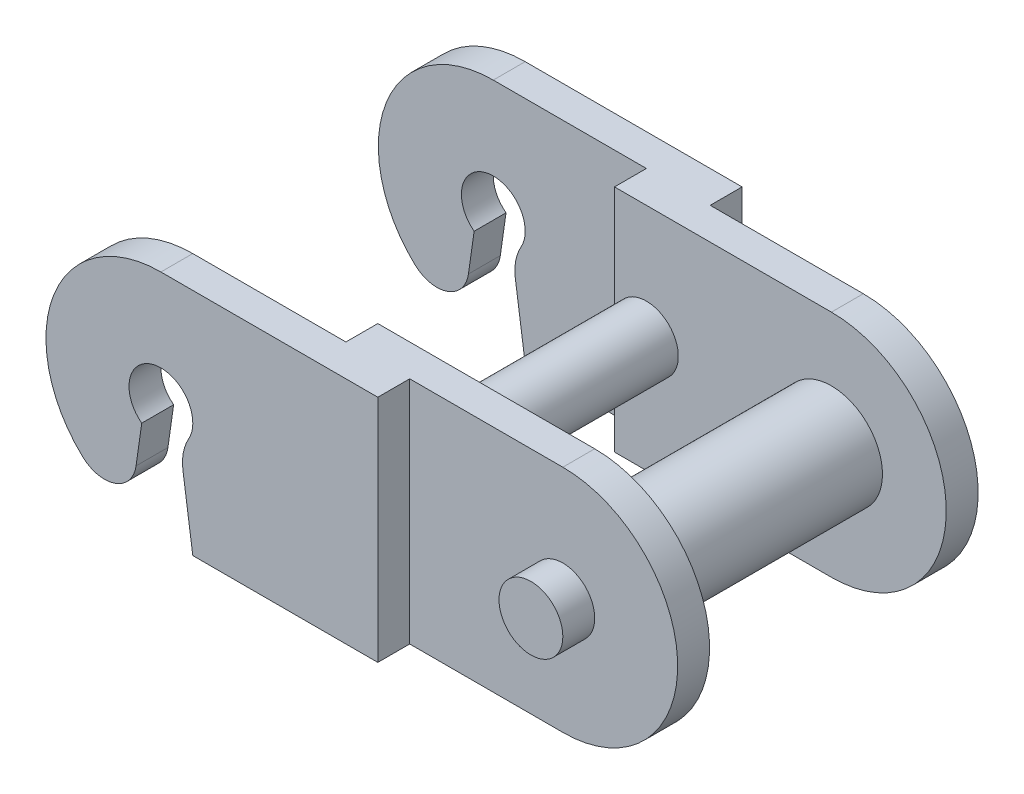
ISO-10303-21;
HEADER;
FILE_DESCRIPTION(('STEP AP214'),'2;1');
FILE_NAME('part.step','',(''),(''),'','','');
FILE_SCHEMA(('AUTOMOTIVE_DESIGN { 1 0 10303 214 1 1 1 1 }'));
ENDSEC;
DATA;
#1=APPLICATION_CONTEXT('core data for automotive mechanical design processes');
#2=APPLICATION_PROTOCOL_DEFINITION('international standard','automotive_design',2000,#1);
#3=PRODUCT_CONTEXT('',#1,'mechanical');
#4=PRODUCT('Part','Part','',(#3));
#5=PRODUCT_RELATED_PRODUCT_CATEGORY('part','',(#4));
#6=PRODUCT_DEFINITION_FORMATION('','',#4);
#7=PRODUCT_DEFINITION_CONTEXT('part definition',#1,'design');
#8=PRODUCT_DEFINITION('design','',#6,#7);
#9=PRODUCT_DEFINITION_SHAPE('','',#8);
#10=(LENGTH_UNIT() NAMED_UNIT(*) SI_UNIT(.MILLI.,.METRE.));
#11=(NAMED_UNIT(*) PLANE_ANGLE_UNIT() SI_UNIT($,.RADIAN.));
#12=(NAMED_UNIT(*) SI_UNIT($,.STERADIAN.) SOLID_ANGLE_UNIT());
#13=UNCERTAINTY_MEASURE_WITH_UNIT(LENGTH_MEASURE(1.E-05),#10,'distance_accuracy_value','');
#14=(GEOMETRIC_REPRESENTATION_CONTEXT(3) GLOBAL_UNCERTAINTY_ASSIGNED_CONTEXT((#13)) GLOBAL_UNIT_ASSIGNED_CONTEXT((#10,
#11,#12)) REPRESENTATION_CONTEXT('',''));
#15=CARTESIAN_POINT('',(0.,0.,0.));
#16=DIRECTION('',(0.,0.,1.));
#17=DIRECTION('',(1.,0.,0.));
#18=AXIS2_PLACEMENT_3D('',#15,#16,#17);
#19=CARTESIAN_POINT('',(-2.79567818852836,-1.8,-2.855));
#20=DIRECTION('',(0.,-1.,0.));
#21=DIRECTION('',(0.,0.,-1.));
#22=AXIS2_PLACEMENT_3D('',#19,#20,#21);
#23=PLANE('',#22);
#24=DIRECTION('',(-1.,0.,0.));
#25=VECTOR('',#24,1.);
#26=CARTESIAN_POINT('',(-0.5,-1.8,-2.355));
#27=LINE('',#26,#25);
#28=CARTESIAN_POINT('',(-0.5,-1.8,-2.355));
#29=VERTEX_POINT('',#28);
#30=CARTESIAN_POINT('',(-2.4,-1.8,-2.355));
#31=VERTEX_POINT('',#30);
#32=EDGE_CURVE('E246',#29,#31,#27,.T.);
#33=ORIENTED_EDGE('',*,*,#32,.T.);
#34=DIRECTION('',(0.,0.,1.));
#35=VECTOR('',#34,1.);
#36=CARTESIAN_POINT('',(-2.4,-1.8,-2.855));
#37=LINE('',#36,#35);
#38=CARTESIAN_POINT('',(-2.4,-1.8,-2.855));
#39=VERTEX_POINT('',#38);
#40=EDGE_CURVE('E222',#39,#31,#37,.T.);
#41=ORIENTED_EDGE('',*,*,#40,.F.);
#42=DIRECTION('',(1.,0.,0.));
#43=VECTOR('',#42,1.);
#44=CARTESIAN_POINT('',(-0.5,-1.8,-2.855));
#45=LINE('',#44,#43);
#46=CARTESIAN_POINT('',(0.5,-1.8,-2.855));
#47=VERTEX_POINT('',#46);
#48=EDGE_CURVE('E282',#39,#47,#45,.T.);
#49=ORIENTED_EDGE('',*,*,#48,.T.);
#50=DIRECTION('',(0.,0.,1.));
#51=VECTOR('',#50,1.);
#52=CARTESIAN_POINT('',(0.5,-1.8,-3.355));
#53=LINE('',#52,#51);
#54=CARTESIAN_POINT('',(0.5,-1.8,-2.355));
#55=VERTEX_POINT('',#54);
#56=EDGE_CURVE('E266',#47,#55,#53,.T.);
#57=ORIENTED_EDGE('',*,*,#56,.T.);
#58=DIRECTION('',(-1.,0.,0.));
#59=VECTOR('',#58,1.);
#60=CARTESIAN_POINT('',(0.5,-1.8,-2.355));
#61=LINE('',#60,#59);
#62=CARTESIAN_POINT('',(2.9,-1.8,-2.355));
#63=VERTEX_POINT('',#62);
#64=EDGE_CURVE('E262',#63,#55,#61,.T.);
#65=ORIENTED_EDGE('',*,*,#64,.F.);
#66=DIRECTION('',(0.,0.,1.));
#67=VECTOR('',#66,1.);
#68=CARTESIAN_POINT('',(2.9,-1.8,-2.855));
#69=LINE('',#68,#67);
#70=CARTESIAN_POINT('',(2.9,-1.8,-1.855));
#71=VERTEX_POINT('',#70);
#72=EDGE_CURVE('E284',#63,#71,#69,.T.);
#73=ORIENTED_EDGE('',*,*,#72,.T.);
#74=DIRECTION('',(1.,0.,0.));
#75=VECTOR('',#74,1.);
#76=CARTESIAN_POINT('',(-2.79567818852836,-1.8,-1.855));
#77=LINE('',#76,#75);
#78=CARTESIAN_POINT('',(-0.5,-1.8,-1.855));
#79=VERTEX_POINT('',#78);
#80=EDGE_CURVE('E279',#79,#71,#77,.T.);
#81=ORIENTED_EDGE('',*,*,#80,.F.);
#82=DIRECTION('',(0.,0.,1.));
#83=VECTOR('',#82,1.);
#84=CARTESIAN_POINT('',(-0.5,-1.8,-2.355));
#85=LINE('',#84,#83);
#86=EDGE_CURVE('E252',#29,#79,#85,.T.);
#87=ORIENTED_EDGE('',*,*,#86,.F.);
#88=EDGE_LOOP('',(#33,#41,#49,#57,#65,#73,#81,#87));
#89=FACE_BOUND('',#88,.T.);
#90=ADVANCED_FACE('F33',(#89),#23,.T.);
#91=CARTESIAN_POINT('',(-2.9,1.8,-2.855));
#92=DIRECTION('',(0.,-1.,0.));
#93=DIRECTION('',(0.,0.,-1.));
#94=AXIS2_PLACEMENT_3D('',#91,#92,#93);
#95=PLANE('',#94);
#96=DIRECTION('',(0.,0.,1.));
#97=VECTOR('',#96,1.);
#98=CARTESIAN_POINT('',(-0.5,1.8,-2.355));
#99=LINE('',#98,#97);
#100=CARTESIAN_POINT('',(-0.5,1.8,-2.355));
#101=VERTEX_POINT('',#100);
#102=CARTESIAN_POINT('',(-0.5,1.8,-1.855));
#103=VERTEX_POINT('',#102);
#104=EDGE_CURVE('E249',#101,#103,#99,.T.);
#105=ORIENTED_EDGE('',*,*,#104,.T.);
#106=DIRECTION('',(1.,0.,0.));
#107=VECTOR('',#106,1.);
#108=CARTESIAN_POINT('',(-2.9,1.8,-1.855));
#109=LINE('',#108,#107);
#110=CARTESIAN_POINT('',(2.9,1.8,-1.855));
#111=VERTEX_POINT('',#110);
#112=EDGE_CURVE('E274',#103,#111,#109,.T.);
#113=ORIENTED_EDGE('',*,*,#112,.T.);
#114=DIRECTION('',(0.,0.,1.));
#115=VECTOR('',#114,1.);
#116=CARTESIAN_POINT('',(2.9,1.8,-2.855));
#117=LINE('',#116,#115);
#118=CARTESIAN_POINT('',(2.9,1.8,-2.355));
#119=VERTEX_POINT('',#118);
#120=EDGE_CURVE('E292',#119,#111,#117,.T.);
#121=ORIENTED_EDGE('',*,*,#120,.F.);
#122=DIRECTION('',(1.,0.,0.));
#123=VECTOR('',#122,1.);
#124=CARTESIAN_POINT('',(0.5,1.8,-2.355));
#125=LINE('',#124,#123);
#126=CARTESIAN_POINT('',(0.5,1.8,-2.355));
#127=VERTEX_POINT('',#126);
#128=EDGE_CURVE('E264',#127,#119,#125,.T.);
#129=ORIENTED_EDGE('',*,*,#128,.F.);
#130=DIRECTION('',(0.,0.,1.));
#131=VECTOR('',#130,1.);
#132=CARTESIAN_POINT('',(0.5,1.8,-3.355));
#133=LINE('',#132,#131);
#134=CARTESIAN_POINT('',(0.5,1.8,-2.855));
#135=VERTEX_POINT('',#134);
#136=EDGE_CURVE('E267',#135,#127,#133,.T.);
#137=ORIENTED_EDGE('',*,*,#136,.F.);
#138=DIRECTION('',(1.,0.,0.));
#139=VECTOR('',#138,1.);
#140=CARTESIAN_POINT('',(-2.9,1.8,-2.855));
#141=LINE('',#140,#139);
#142=CARTESIAN_POINT('',(-2.9,1.8,-2.855));
#143=VERTEX_POINT('',#142);
#144=EDGE_CURVE('E278',#143,#135,#141,.T.);
#145=ORIENTED_EDGE('',*,*,#144,.F.);
#146=DIRECTION('',(0.,0.,1.));
#147=VECTOR('',#146,1.);
#148=CARTESIAN_POINT('',(-2.9,1.8,-2.855));
#149=LINE('',#148,#147);
#150=CARTESIAN_POINT('',(-2.9,1.8,-2.355));
#151=VERTEX_POINT('',#150);
#152=EDGE_CURVE('E295',#143,#151,#149,.T.);
#153=ORIENTED_EDGE('',*,*,#152,.T.);
#154=DIRECTION('',(1.,0.,0.));
#155=VECTOR('',#154,1.);
#156=CARTESIAN_POINT('',(-0.5,1.8,-2.355));
#157=LINE('',#156,#155);
#158=EDGE_CURVE('E243',#151,#101,#157,.T.);
#159=ORIENTED_EDGE('',*,*,#158,.T.);
#160=EDGE_LOOP('',(#105,#113,#121,#129,#137,#145,#153,#159));
#161=FACE_BOUND('',#160,.T.);
#162=ADVANCED_FACE('F456',(#161),#95,.F.);
#163=CARTESIAN_POINT('',(-2.9,-0.0015115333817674,-2.855));
#164=DIRECTION('',(0.,0.,1.));
#165=DIRECTION('',(1.,0.,0.));
#166=AXIS2_PLACEMENT_3D('',#163,#164,#165);
#167=CYLINDRICAL_SURFACE('',#166,1.80151153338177);
#168=CARTESIAN_POINT('',(-2.9,-0.0015115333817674,-2.855));
#169=DIRECTION('',(0.,0.,1.));
#170=DIRECTION('',(1.,0.,0.));
#171=AXIS2_PLACEMENT_3D('',#168,#169,#170);
#172=CIRCLE('',#171,1.80151153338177);
#173=CARTESIAN_POINT('',(-4.1242069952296,-1.32316240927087,-2.855));
#174=VERTEX_POINT('',#173);
#175=EDGE_CURVE('E275',#143,#174,#172,.T.);
#176=ORIENTED_EDGE('',*,*,#175,.T.);
#177=DIRECTION('',(0.,0.,1.));
#178=VECTOR('',#177,1.);
#179=CARTESIAN_POINT('',(-4.1242069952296,-1.32316240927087,-2.855));
#180=LINE('',#179,#178);
#181=CARTESIAN_POINT('',(-4.1242069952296,-1.32316240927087,-2.355));
#182=VERTEX_POINT('',#181);
#183=EDGE_CURVE('E436',#174,#182,#180,.T.);
#184=ORIENTED_EDGE('',*,*,#183,.T.);
#185=CARTESIAN_POINT('',(-2.9,-0.0015115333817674,-2.355));
#186=DIRECTION('',(0.,0.,1.));
#187=DIRECTION('',(1.,0.,0.));
#188=AXIS2_PLACEMENT_3D('',#185,#186,#187);
#189=CIRCLE('',#188,1.80151153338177);
#190=EDGE_CURVE('E426',#182,#151,#189,.F.);
#191=ORIENTED_EDGE('',*,*,#190,.T.);
#192=ORIENTED_EDGE('',*,*,#152,.F.);
#193=EDGE_LOOP('',(#176,#184,#191,#192));
#194=FACE_BOUND('',#193,.T.);
#195=ADVANCED_FACE('F451',(#194),#167,.T.);
#196=CARTESIAN_POINT('',(-2.9,-0.0015115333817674,-1.855));
#197=DIRECTION('',(0.,0.,-1.));
#198=DIRECTION('',(1.,0.,0.));
#199=AXIS2_PLACEMENT_3D('',#196,#197,#198);
#200=PLANE('',#199);
#201=CARTESIAN_POINT('',(2.9,0.,-1.855));
#202=DIRECTION('',(0.,0.,-1.));
#203=DIRECTION('',(-1.,0.,0.));
#204=AXIS2_PLACEMENT_3D('',#201,#202,#203);
#205=CIRCLE('',#204,0.8);
#206=CARTESIAN_POINT('',(2.1,0.,-1.855));
#207=VERTEX_POINT('',#206);
#208=EDGE_CURVE('E298',#207,#207,#205,.T.);
#209=ORIENTED_EDGE('',*,*,#208,.T.);
#210=EDGE_LOOP('',(#209));
#211=FACE_BOUND('',#210,.T.);
#212=DIRECTION('',(0.,1.,0.));
#213=VECTOR('',#212,1.);
#214=CARTESIAN_POINT('',(-0.5,-0.00151153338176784,-1.855));
#215=LINE('',#214,#213);
#216=CARTESIAN_POINT('',(-0.5,0.,-1.855));
#217=VERTEX_POINT('',#216);
#218=EDGE_CURVE('E424',#79,#217,#215,.T.);
#219=ORIENTED_EDGE('',*,*,#218,.F.);
#220=ORIENTED_EDGE('',*,*,#80,.T.);
#221=CARTESIAN_POINT('',(2.9,0.,-1.855));
#222=DIRECTION('',(0.,0.,-1.));
#223=DIRECTION('',(-1.,0.,0.));
#224=AXIS2_PLACEMENT_3D('',#221,#222,#223);
#225=CIRCLE('',#224,1.8);
#226=EDGE_CURVE('E286',#111,#71,#225,.T.);
#227=ORIENTED_EDGE('',*,*,#226,.F.);
#228=ORIENTED_EDGE('',*,*,#112,.F.);
#229=DIRECTION('',(0.,-1.,0.));
#230=VECTOR('',#229,1.);
#231=CARTESIAN_POINT('',(-0.5,1.8,-1.855));
#232=LINE('',#231,#230);
#233=EDGE_CURVE('E221',#103,#217,#232,.T.);
#234=ORIENTED_EDGE('',*,*,#233,.T.);
#235=CARTESIAN_POINT('',(0.,0.,-1.855));
#236=DIRECTION('',(0.,0.,-1.));
#237=DIRECTION('',(-1.,0.,0.));
#238=AXIS2_PLACEMENT_3D('',#235,#236,#237);
#239=CIRCLE('',#238,0.5);
#240=EDGE_CURVE('E301',#217,#217,#239,.T.);
#241=ORIENTED_EDGE('',*,*,#240,.T.);
#242=EDGE_LOOP('',(#219,#220,#227,#228,#234,#241));
#243=FACE_BOUND('',#242,.T.);
#244=ADVANCED_FACE('F481',(#211,#243),#200,.F.);
#245=CARTESIAN_POINT('',(2.9,0.,-2.855));
#246=DIRECTION('',(0.,0.,1.));
#247=DIRECTION('',(1.,0.,0.));
#248=AXIS2_PLACEMENT_3D('',#245,#246,#247);
#249=CYLINDRICAL_SURFACE('',#248,1.8);
#250=CARTESIAN_POINT('',(2.9,0.,-2.355));
#251=DIRECTION('',(0.,0.,-1.));
#252=DIRECTION('',(-1.,0.,0.));
#253=AXIS2_PLACEMENT_3D('',#250,#251,#252);
#254=CIRCLE('',#253,1.8);
#255=EDGE_CURVE('E272',#119,#63,#254,.T.);
#256=ORIENTED_EDGE('',*,*,#255,.F.);
#257=ORIENTED_EDGE('',*,*,#120,.T.);
#258=ORIENTED_EDGE('',*,*,#226,.T.);
#259=ORIENTED_EDGE('',*,*,#72,.F.);
#260=EDGE_LOOP('',(#256,#257,#258,#259));
#261=FACE_BOUND('',#260,.T.);
#262=ADVANCED_FACE('F483',(#261),#249,.T.);
#263=CARTESIAN_POINT('',(-2.9,-0.0015115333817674,2.855));
#264=DIRECTION('',(0.,0.,-1.));
#265=DIRECTION('',(-1.,0.,0.));
#266=AXIS2_PLACEMENT_3D('',#263,#264,#265);
#267=CYLINDRICAL_SURFACE('',#266,1.80151153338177);
#268=CARTESIAN_POINT('',(-2.9,-0.0015115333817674,2.355));
#269=DIRECTION('',(0.,0.,-1.));
#270=DIRECTION('',(-1.,0.,0.));
#271=AXIS2_PLACEMENT_3D('',#268,#269,#270);
#272=CIRCLE('',#271,1.80151153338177);
#273=CARTESIAN_POINT('',(-4.1242069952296,-1.32316240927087,2.355));
#274=VERTEX_POINT('',#273);
#275=CARTESIAN_POINT('',(-2.9,1.8,2.355));
#276=VERTEX_POINT('',#275);
#277=EDGE_CURVE('E330',#274,#276,#272,.T.);
#278=ORIENTED_EDGE('',*,*,#277,.F.);
#279=DIRECTION('',(0.,0.,-1.));
#280=VECTOR('',#279,1.);
#281=CARTESIAN_POINT('',(-4.1242069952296,-1.32316240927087,2.855));
#282=LINE('',#281,#280);
#283=CARTESIAN_POINT('',(-4.1242069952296,-1.32316240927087,2.855));
#284=VERTEX_POINT('',#283);
#285=EDGE_CURVE('E406',#274,#284,#282,.F.);
#286=ORIENTED_EDGE('',*,*,#285,.T.);
#287=CARTESIAN_POINT('',(-2.9,-0.0015115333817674,2.855));
#288=DIRECTION('',(0.,0.,1.));
#289=DIRECTION('',(1.,0.,0.));
#290=AXIS2_PLACEMENT_3D('',#287,#288,#289);
#291=CIRCLE('',#290,1.80151153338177);
#292=CARTESIAN_POINT('',(-2.9,1.8,2.855));
#293=VERTEX_POINT('',#292);
#294=EDGE_CURVE('E356',#293,#284,#291,.T.);
#295=ORIENTED_EDGE('',*,*,#294,.F.);
#296=DIRECTION('',(0.,0.,-1.));
#297=VECTOR('',#296,1.);
#298=CARTESIAN_POINT('',(-2.9,1.8,2.855));
#299=LINE('',#298,#297);
#300=EDGE_CURVE('E365',#293,#276,#299,.T.);
#301=ORIENTED_EDGE('',*,*,#300,.T.);
#302=EDGE_LOOP('',(#278,#286,#295,#301));
#303=FACE_BOUND('',#302,.T.);
#304=ADVANCED_FACE('F485',(#303),#267,.T.);
#305=CARTESIAN_POINT('',(-2.9,-0.0015115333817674,2.855));
#306=DIRECTION('',(0.,0.,1.));
#307=DIRECTION('',(1.,0.,0.));
#308=AXIS2_PLACEMENT_3D('',#305,#306,#307);
#309=PLANE('',#308);
#310=CARTESIAN_POINT('',(-2.9,-0.0015115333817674,2.855));
#311=DIRECTION('',(0.,0.,-1.));
#312=DIRECTION('',(-1.,0.,0.));
#313=AXIS2_PLACEMENT_3D('',#310,#311,#312);
#314=CIRCLE('',#313,0.5);
#315=CARTESIAN_POINT('',(-3.2,-0.401511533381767,2.855));
#316=VERTEX_POINT('',#315);
#317=CARTESIAN_POINT('',(-2.46465953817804,-0.247435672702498,2.855));
#318=VERTEX_POINT('',#317);
#319=EDGE_CURVE('E309',#316,#318,#314,.T.);
#320=ORIENTED_EDGE('',*,*,#319,.T.);
#321=CARTESIAN_POINT('',(-1.8116488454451,-0.616321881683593,2.855));
#322=DIRECTION('',(0.,0.,1.));
#323=DIRECTION('',(1.,0.,0.));
#324=AXIS2_PLACEMENT_3D('',#321,#322,#323);
#325=CIRCLE('',#324,0.75);
#326=CARTESIAN_POINT('',(-2.55409490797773,-0.722500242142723,2.855));
#327=VERTEX_POINT('',#326);
#328=EDGE_CURVE('E417',#318,#327,#325,.T.);
#329=ORIENTED_EDGE('',*,*,#328,.T.);
#330=DIRECTION('',(0.14157114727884,-0.989928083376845,0.));
#331=VECTOR('',#330,1.);
#332=CARTESIAN_POINT('',(-2.6,-0.401511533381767,2.855));
#333=LINE('',#332,#331);
#334=CARTESIAN_POINT('',(-2.4,-1.8,2.855));
#335=VERTEX_POINT('',#334);
#336=EDGE_CURVE('E307',#327,#335,#333,.T.);
#337=ORIENTED_EDGE('',*,*,#336,.T.);
#338=DIRECTION('',(1.,0.,0.));
#339=VECTOR('',#338,1.);
#340=CARTESIAN_POINT('',(-2.79567818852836,-1.8,2.855));
#341=LINE('',#340,#339);
#342=CARTESIAN_POINT('',(0.5,-1.8,2.855));
#343=VERTEX_POINT('',#342);
#344=EDGE_CURVE('E359',#335,#343,#341,.T.);
#345=ORIENTED_EDGE('',*,*,#344,.T.);
#346=DIRECTION('',(0.,-1.,0.));
#347=VECTOR('',#346,1.);
#348=CARTESIAN_POINT('',(0.5,-0.00151153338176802,2.855));
#349=LINE('',#348,#347);
#350=CARTESIAN_POINT('',(0.5,1.8,2.855));
#351=VERTEX_POINT('',#350);
#352=EDGE_CURVE('E385',#351,#343,#349,.T.);
#353=ORIENTED_EDGE('',*,*,#352,.F.);
#354=DIRECTION('',(1.,0.,0.));
#355=VECTOR('',#354,1.);
#356=CARTESIAN_POINT('',(-2.9,1.8,2.855));
#357=LINE('',#356,#355);
#358=EDGE_CURVE('E362',#293,#351,#357,.T.);
#359=ORIENTED_EDGE('',*,*,#358,.F.);
#360=ORIENTED_EDGE('',*,*,#294,.T.);
#361=CARTESIAN_POINT('',(-3.78443481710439,-0.956345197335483,2.855));
#362=DIRECTION('',(0.,0.,1.));
#363=DIRECTION('',(1.,0.,0.));
#364=AXIS2_PLACEMENT_3D('',#361,#362,#363);
#365=CIRCLE('',#364,0.5);
#366=CARTESIAN_POINT('',(-3.28947077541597,-1.0271307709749,2.855));
#367=VERTEX_POINT('',#366);
#368=EDGE_CURVE('E408',#284,#367,#365,.T.);
#369=ORIENTED_EDGE('',*,*,#368,.T.);
#370=DIRECTION('',(-0.14157114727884,-0.989928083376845,0.));
#371=VECTOR('',#370,1.);
#372=CARTESIAN_POINT('',(-3.2,-0.401511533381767,2.855));
#373=LINE('',#372,#371);
#374=EDGE_CURVE('E304',#316,#367,#373,.T.);
#375=ORIENTED_EDGE('',*,*,#374,.F.);
#376=EDGE_LOOP('',(#320,#329,#337,#345,#353,#359,#360,#369,#375));
#377=FACE_BOUND('',#376,.T.);
#378=ADVANCED_FACE('F508',(#377),#309,.T.);
#379=CARTESIAN_POINT('',(0.,0.,2.355));
#380=DIRECTION('',(0.,0.,-1.));
#381=DIRECTION('',(-1.,0.,0.));
#382=AXIS2_PLACEMENT_3D('',#379,#380,#381);
#383=PLANE('',#382);
#384=DIRECTION('',(0.14157114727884,-0.989928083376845,0.));
#385=VECTOR('',#384,1.);
#386=CARTESIAN_POINT('',(-2.60415972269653,-0.372424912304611,2.355));
#387=LINE('',#386,#385);
#388=CARTESIAN_POINT('',(-2.55409490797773,-0.722500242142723,2.355));
#389=VERTEX_POINT('',#388);
#390=CARTESIAN_POINT('',(-2.4,-1.8,2.355));
#391=VERTEX_POINT('',#390);
#392=EDGE_CURVE('E396',#389,#391,#387,.T.);
#393=ORIENTED_EDGE('',*,*,#392,.F.);
#394=CARTESIAN_POINT('',(-1.8116488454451,-0.616321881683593,2.355));
#395=DIRECTION('',(0.,0.,-1.));
#396=DIRECTION('',(-1.,0.,0.));
#397=AXIS2_PLACEMENT_3D('',#394,#395,#396);
#398=CIRCLE('',#397,0.75);
#399=CARTESIAN_POINT('',(-2.46465953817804,-0.247435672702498,2.355));
#400=VERTEX_POINT('',#399);
#401=EDGE_CURVE('E413',#389,#400,#398,.T.);
#402=ORIENTED_EDGE('',*,*,#401,.T.);
#403=CARTESIAN_POINT('',(-2.9,-0.0015115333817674,2.355));
#404=DIRECTION('',(0.,0.,-1.));
#405=DIRECTION('',(-1.,0.,0.));
#406=AXIS2_PLACEMENT_3D('',#403,#404,#405);
#407=CIRCLE('',#406,0.5);
#408=CARTESIAN_POINT('',(-3.2,-0.401511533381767,2.355));
#409=VERTEX_POINT('',#408);
#410=EDGE_CURVE('E393',#409,#400,#407,.T.);
#411=ORIENTED_EDGE('',*,*,#410,.F.);
#412=DIRECTION('',(-0.14157114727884,-0.989928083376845,0.));
#413=VECTOR('',#412,1.);
#414=CARTESIAN_POINT('',(-3.07959441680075,0.440417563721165,2.355));
#415=LINE('',#414,#413);
#416=CARTESIAN_POINT('',(-3.28947077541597,-1.0271307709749,2.355));
#417=VERTEX_POINT('',#416);
#418=EDGE_CURVE('E398',#409,#417,#415,.T.);
#419=ORIENTED_EDGE('',*,*,#418,.T.);
#420=CARTESIAN_POINT('',(-3.78443481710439,-0.956345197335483,2.355));
#421=DIRECTION('',(0.,0.,-1.));
#422=DIRECTION('',(-1.,0.,0.));
#423=AXIS2_PLACEMENT_3D('',#420,#421,#422);
#424=CIRCLE('',#423,0.5);
#425=EDGE_CURVE('E404',#417,#274,#424,.T.);
#426=ORIENTED_EDGE('',*,*,#425,.T.);
#427=ORIENTED_EDGE('',*,*,#277,.T.);
#428=DIRECTION('',(1.,0.,0.));
#429=VECTOR('',#428,1.);
#430=CARTESIAN_POINT('',(-0.5,1.8,2.355));
#431=LINE('',#430,#429);
#432=CARTESIAN_POINT('',(-0.5,1.8,2.355));
#433=VERTEX_POINT('',#432);
#434=EDGE_CURVE('E324',#276,#433,#431,.T.);
#435=ORIENTED_EDGE('',*,*,#434,.T.);
#436=DIRECTION('',(0.,-1.,0.));
#437=VECTOR('',#436,1.);
#438=CARTESIAN_POINT('',(-0.5,1.8,2.355));
#439=LINE('',#438,#437);
#440=CARTESIAN_POINT('',(-0.5,-1.8,2.355));
#441=VERTEX_POINT('',#440);
#442=EDGE_CURVE('E318',#433,#441,#439,.T.);
#443=ORIENTED_EDGE('',*,*,#442,.T.);
#444=DIRECTION('',(-1.,0.,0.));
#445=VECTOR('',#444,1.);
#446=CARTESIAN_POINT('',(-0.5,-1.8,2.355));
#447=LINE('',#446,#445);
#448=EDGE_CURVE('E321',#441,#391,#447,.T.);
#449=ORIENTED_EDGE('',*,*,#448,.T.);
#450=EDGE_LOOP('',(#393,#402,#411,#419,#426,#427,#435,#443,#449));
#451=FACE_BOUND('',#450,.T.);
#452=ADVANCED_FACE('F504',(#451),#383,.T.);
#453=CARTESIAN_POINT('',(-2.9,-0.0015115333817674,1.855));
#454=DIRECTION('',(0.,0.,1.));
#455=DIRECTION('',(1.,0.,0.));
#456=AXIS2_PLACEMENT_3D('',#453,#454,#455);
#457=PLANE('',#456);
#458=DIRECTION('',(1.,0.,0.));
#459=VECTOR('',#458,1.);
#460=CARTESIAN_POINT('',(-0.5,-1.8,1.855));
#461=LINE('',#460,#459);
#462=CARTESIAN_POINT('',(-0.5,-1.8,1.855));
#463=VERTEX_POINT('',#462);
#464=CARTESIAN_POINT('',(2.9,-1.8,1.855));
#465=VERTEX_POINT('',#464);
#466=EDGE_CURVE('E355',#463,#465,#461,.T.);
#467=ORIENTED_EDGE('',*,*,#466,.F.);
#468=DIRECTION('',(0.,1.,0.));
#469=VECTOR('',#468,1.);
#470=CARTESIAN_POINT('',(-0.5,-0.00151153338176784,1.855));
#471=LINE('',#470,#469);
#472=CARTESIAN_POINT('',(-0.5,0.,1.855));
#473=VERTEX_POINT('',#472);
#474=EDGE_CURVE('E390',#463,#473,#471,.T.);
#475=ORIENTED_EDGE('',*,*,#474,.T.);
#476=CARTESIAN_POINT('',(0.,0.,1.855));
#477=DIRECTION('',(0.,0.,1.));
#478=DIRECTION('',(1.,0.,0.));
#479=AXIS2_PLACEMENT_3D('',#476,#477,#478);
#480=CIRCLE('',#479,0.5);
#481=EDGE_CURVE('E379',#473,#473,#480,.T.);
#482=ORIENTED_EDGE('',*,*,#481,.T.);
#483=DIRECTION('',(0.,-1.,0.));
#484=VECTOR('',#483,1.);
#485=CARTESIAN_POINT('',(-0.5,1.8,1.855));
#486=LINE('',#485,#484);
#487=CARTESIAN_POINT('',(-0.5,1.8,1.855));
#488=VERTEX_POINT('',#487);
#489=EDGE_CURVE('E317',#488,#473,#486,.T.);
#490=ORIENTED_EDGE('',*,*,#489,.F.);
#491=DIRECTION('',(1.,0.,0.));
#492=VECTOR('',#491,1.);
#493=CARTESIAN_POINT('',(-2.9,1.8,1.855));
#494=LINE('',#493,#492);
#495=CARTESIAN_POINT('',(2.9,1.8,1.855));
#496=VERTEX_POINT('',#495);
#497=EDGE_CURVE('E360',#488,#496,#494,.T.);
#498=ORIENTED_EDGE('',*,*,#497,.T.);
#499=CARTESIAN_POINT('',(2.9,0.,1.855));
#500=DIRECTION('',(0.,0.,-1.));
#501=DIRECTION('',(-1.,0.,0.));
#502=AXIS2_PLACEMENT_3D('',#499,#500,#501);
#503=CIRCLE('',#502,1.8);
#504=EDGE_CURVE('E367',#496,#465,#503,.T.);
#505=ORIENTED_EDGE('',*,*,#504,.T.);
#506=EDGE_LOOP('',(#467,#475,#482,#490,#498,#505));
#507=FACE_BOUND('',#506,.T.);
#508=CARTESIAN_POINT('',(2.9,0.,1.855));
#509=DIRECTION('',(0.,0.,1.));
#510=DIRECTION('',(1.,0.,0.));
#511=AXIS2_PLACEMENT_3D('',#508,#509,#510);
#512=CIRCLE('',#511,0.8);
#513=CARTESIAN_POINT('',(2.1,0.,1.855));
#514=VERTEX_POINT('',#513);
#515=EDGE_CURVE('E382',#514,#514,#512,.F.);
#516=ORIENTED_EDGE('',*,*,#515,.F.);
#517=EDGE_LOOP('',(#516));
#518=FACE_BOUND('',#517,.T.);
#519=ADVANCED_FACE('F507',(#507,#518),#457,.F.);
#520=CARTESIAN_POINT('',(2.9,0.,2.855));
#521=DIRECTION('',(0.,0.,-1.));
#522=DIRECTION('',(-1.,0.,0.));
#523=AXIS2_PLACEMENT_3D('',#520,#521,#522);
#524=CYLINDRICAL_SURFACE('',#523,1.8);
#525=DIRECTION('',(0.,0.,-1.));
#526=VECTOR('',#525,1.);
#527=CARTESIAN_POINT('',(2.9,1.8,2.855));
#528=LINE('',#527,#526);
#529=CARTESIAN_POINT('',(2.9,1.8,2.355));
#530=VERTEX_POINT('',#529);
#531=EDGE_CURVE('E373',#530,#496,#528,.T.);
#532=ORIENTED_EDGE('',*,*,#531,.F.);
#533=CARTESIAN_POINT('',(2.9,0.,2.355));
#534=DIRECTION('',(0.,0.,1.));
#535=DIRECTION('',(1.,0.,0.));
#536=AXIS2_PLACEMENT_3D('',#533,#534,#535);
#537=CIRCLE('',#536,1.8);
#538=CARTESIAN_POINT('',(2.9,-1.8,2.355));
#539=VERTEX_POINT('',#538);
#540=EDGE_CURVE('E352',#530,#539,#537,.F.);
#541=ORIENTED_EDGE('',*,*,#540,.T.);
#542=DIRECTION('',(0.,0.,-1.));
#543=VECTOR('',#542,1.);
#544=CARTESIAN_POINT('',(2.9,-1.8,2.855));
#545=LINE('',#544,#543);
#546=EDGE_CURVE('E376',#539,#465,#545,.T.);
#547=ORIENTED_EDGE('',*,*,#546,.T.);
#548=ORIENTED_EDGE('',*,*,#504,.F.);
#549=EDGE_LOOP('',(#532,#541,#547,#548));
#550=FACE_BOUND('',#549,.T.);
#551=ADVANCED_FACE('F536',(#550),#524,.T.);
#552=CARTESIAN_POINT('',(0.,0.,1.855));
#553=DIRECTION('',(0.,0.,-1.));
#554=DIRECTION('',(-1.,0.,0.));
#555=AXIS2_PLACEMENT_3D('',#552,#553,#554);
#556=CYLINDRICAL_SURFACE('',#555,0.5);
#557=ORIENTED_EDGE('',*,*,#481,.F.);
#558=EDGE_LOOP('',(#557));
#559=FACE_BOUND('',#558,.T.);
#560=ORIENTED_EDGE('',*,*,#240,.F.);
#561=EDGE_LOOP('',(#560));
#562=FACE_BOUND('',#561,.T.);
#563=ADVANCED_FACE('F544',(#559,#562),#556,.T.);
#564=CARTESIAN_POINT('',(-0.5,-1.8,2.855));
#565=DIRECTION('',(0.,1.,0.));
#566=DIRECTION('',(0.,0.,1.));
#567=AXIS2_PLACEMENT_3D('',#564,#565,#566);
#568=PLANE('',#567);
#569=ORIENTED_EDGE('',*,*,#344,.F.);
#570=DIRECTION('',(0.,0.,-1.));
#571=VECTOR('',#570,1.);
#572=CARTESIAN_POINT('',(-2.4,-1.8,2.855));
#573=LINE('',#572,#571);
#574=EDGE_CURVE('E314',#335,#391,#573,.T.);
#575=ORIENTED_EDGE('',*,*,#574,.T.);
#576=ORIENTED_EDGE('',*,*,#448,.F.);
#577=DIRECTION('',(0.,0.,-1.));
#578=VECTOR('',#577,1.);
#579=CARTESIAN_POINT('',(-0.5,-1.8,2.355));
#580=LINE('',#579,#578);
#581=EDGE_CURVE('E326',#441,#463,#580,.T.);
#582=ORIENTED_EDGE('',*,*,#581,.T.);
#583=ORIENTED_EDGE('',*,*,#466,.T.);
#584=ORIENTED_EDGE('',*,*,#546,.F.);
#585=DIRECTION('',(-1.,0.,0.));
#586=VECTOR('',#585,1.);
#587=CARTESIAN_POINT('',(0.5,-1.8,2.355));
#588=LINE('',#587,#586);
#589=CARTESIAN_POINT('',(0.5,-1.8,2.355));
#590=VERTEX_POINT('',#589);
#591=EDGE_CURVE('E343',#539,#590,#588,.T.);
#592=ORIENTED_EDGE('',*,*,#591,.T.);
#593=DIRECTION('',(0.,0.,-1.));
#594=VECTOR('',#593,1.);
#595=CARTESIAN_POINT('',(0.5,-1.8,3.355));
#596=LINE('',#595,#594);
#597=EDGE_CURVE('E347',#343,#590,#596,.T.);
#598=ORIENTED_EDGE('',*,*,#597,.F.);
#599=EDGE_LOOP('',(#569,#575,#576,#582,#583,#584,#592,#598));
#600=FACE_BOUND('',#599,.T.);
#601=ADVANCED_FACE('F540',(#600),#568,.F.);
#602=CARTESIAN_POINT('',(-2.9,1.8,2.855));
#603=DIRECTION('',(0.,1.,0.));
#604=DIRECTION('',(0.,0.,1.));
#605=AXIS2_PLACEMENT_3D('',#602,#603,#604);
#606=PLANE('',#605);
#607=DIRECTION('',(0.,0.,-1.));
#608=VECTOR('',#607,1.);
#609=CARTESIAN_POINT('',(-0.5,1.8,2.355));
#610=LINE('',#609,#608);
#611=EDGE_CURVE('E328',#433,#488,#610,.T.);
#612=ORIENTED_EDGE('',*,*,#611,.F.);
#613=ORIENTED_EDGE('',*,*,#434,.F.);
#614=ORIENTED_EDGE('',*,*,#300,.F.);
#615=ORIENTED_EDGE('',*,*,#358,.T.);
#616=DIRECTION('',(0.,0.,-1.));
#617=VECTOR('',#616,1.);
#618=CARTESIAN_POINT('',(0.5,1.8,3.355));
#619=LINE('',#618,#617);
#620=CARTESIAN_POINT('',(0.5,1.8,2.355));
#621=VERTEX_POINT('',#620);
#622=EDGE_CURVE('E346',#351,#621,#619,.T.);
#623=ORIENTED_EDGE('',*,*,#622,.T.);
#624=DIRECTION('',(1.,0.,0.));
#625=VECTOR('',#624,1.);
#626=CARTESIAN_POINT('',(0.5,1.8,2.355));
#627=LINE('',#626,#625);
#628=EDGE_CURVE('E340',#621,#530,#627,.T.);
#629=ORIENTED_EDGE('',*,*,#628,.T.);
#630=ORIENTED_EDGE('',*,*,#531,.T.);
#631=ORIENTED_EDGE('',*,*,#497,.F.);
#632=EDGE_LOOP('',(#612,#613,#614,#615,#623,#629,#630,#631));
#633=FACE_BOUND('',#632,.T.);
#634=ADVANCED_FACE('F529',(#633),#606,.T.);
#635=CARTESIAN_POINT('',(2.9,0.,1.855));
#636=DIRECTION('',(0.,0.,-1.));
#637=DIRECTION('',(-1.,0.,0.));
#638=AXIS2_PLACEMENT_3D('',#635,#636,#637);
#639=CYLINDRICAL_SURFACE('',#638,0.8);
#640=CARTESIAN_POINT('',(2.1,0.,1.855));
#641=CARTESIAN_POINT('',(2.1,0.,1.81635416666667));
#642=CARTESIAN_POINT('',(2.1,0.,1.77770833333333));
#643=CARTESIAN_POINT('',(2.1,0.,1.70041666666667));
#644=CARTESIAN_POINT('',(2.1,0.,1.66177083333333));
#645=CARTESIAN_POINT('',(2.1,0.,1.58447916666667));
#646=CARTESIAN_POINT('',(2.1,0.,1.54583333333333));
#647=CARTESIAN_POINT('',(2.1,0.,1.46854166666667));
#648=CARTESIAN_POINT('',(2.1,0.,1.42989583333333));
#649=CARTESIAN_POINT('',(2.1,0.,1.35260416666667));
#650=CARTESIAN_POINT('',(2.1,0.,1.31395833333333));
#651=CARTESIAN_POINT('',(2.1,0.,1.23666666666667));
#652=CARTESIAN_POINT('',(2.1,0.,1.19802083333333));
#653=CARTESIAN_POINT('',(2.1,0.,1.12072916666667));
#654=CARTESIAN_POINT('',(2.1,0.,1.08208333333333));
#655=CARTESIAN_POINT('',(2.1,0.,1.00479166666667));
#656=CARTESIAN_POINT('',(2.1,0.,0.966145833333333));
#657=CARTESIAN_POINT('',(2.1,0.,0.888854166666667));
#658=CARTESIAN_POINT('',(2.1,0.,0.850208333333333));
#659=CARTESIAN_POINT('',(2.1,0.,0.772916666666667));
#660=CARTESIAN_POINT('',(2.1,0.,0.734270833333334));
#661=CARTESIAN_POINT('',(2.1,0.,0.656979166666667));
#662=CARTESIAN_POINT('',(2.1,0.,0.618333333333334));
#663=CARTESIAN_POINT('',(2.1,0.,0.541041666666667));
#664=CARTESIAN_POINT('',(2.1,0.,0.502395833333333));
#665=CARTESIAN_POINT('',(2.1,0.,0.425104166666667));
#666=CARTESIAN_POINT('',(2.1,0.,0.386458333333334));
#667=CARTESIAN_POINT('',(2.1,0.,0.309166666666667));
#668=CARTESIAN_POINT('',(2.1,0.,0.270520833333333));
#669=CARTESIAN_POINT('',(2.1,0.,0.193229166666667));
#670=CARTESIAN_POINT('',(2.1,0.,0.154583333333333));
#671=CARTESIAN_POINT('',(2.1,0.,0.0772916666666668));
#672=CARTESIAN_POINT('',(2.1,0.,0.0386458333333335));
#673=CARTESIAN_POINT('',(2.1,0.,-0.0386458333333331));
#674=CARTESIAN_POINT('',(2.1,0.,-0.0772916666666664));
#675=CARTESIAN_POINT('',(2.1,0.,-0.154583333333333));
#676=CARTESIAN_POINT('',(2.1,0.,-0.193229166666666));
#677=CARTESIAN_POINT('',(2.1,0.,-0.270520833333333));
#678=CARTESIAN_POINT('',(2.1,0.,-0.309166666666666));
#679=CARTESIAN_POINT('',(2.1,0.,-0.386458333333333));
#680=CARTESIAN_POINT('',(2.1,0.,-0.425104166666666));
#681=CARTESIAN_POINT('',(2.1,0.,-0.502395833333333));
#682=CARTESIAN_POINT('',(2.1,0.,-0.541041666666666));
#683=CARTESIAN_POINT('',(2.1,0.,-0.618333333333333));
#684=CARTESIAN_POINT('',(2.1,0.,-0.656979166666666));
#685=CARTESIAN_POINT('',(2.1,0.,-0.734270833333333));
#686=CARTESIAN_POINT('',(2.1,0.,-0.772916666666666));
#687=CARTESIAN_POINT('',(2.1,0.,-0.850208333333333));
#688=CARTESIAN_POINT('',(2.1,0.,-0.888854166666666));
#689=CARTESIAN_POINT('',(2.1,0.,-0.966145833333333));
#690=CARTESIAN_POINT('',(2.1,0.,-1.00479166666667));
#691=CARTESIAN_POINT('',(2.1,0.,-1.08208333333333));
#692=CARTESIAN_POINT('',(2.1,0.,-1.12072916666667));
#693=CARTESIAN_POINT('',(2.1,0.,-1.19802083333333));
#694=CARTESIAN_POINT('',(2.1,0.,-1.23666666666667));
#695=CARTESIAN_POINT('',(2.1,0.,-1.31395833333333));
#696=CARTESIAN_POINT('',(2.1,0.,-1.35260416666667));
#697=CARTESIAN_POINT('',(2.1,0.,-1.42989583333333));
#698=CARTESIAN_POINT('',(2.1,0.,-1.46854166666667));
#699=CARTESIAN_POINT('',(2.1,0.,-1.54583333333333));
#700=CARTESIAN_POINT('',(2.1,0.,-1.58447916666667));
#701=CARTESIAN_POINT('',(2.1,0.,-1.66177083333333));
#702=CARTESIAN_POINT('',(2.1,0.,-1.70041666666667));
#703=CARTESIAN_POINT('',(2.1,0.,-1.77770833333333));
#704=CARTESIAN_POINT('',(2.1,0.,-1.81635416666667));
#705=CARTESIAN_POINT('',(2.1,0.,-1.855));
#706=B_SPLINE_CURVE_WITH_KNOTS('',3,(#640,#641,#642,#643,#644,#645,#646,#647,#648,#649,#650,
#651,#652,#653,#654,#655,#656,#657,#658,#659,#660,#661,#662,#663,#664,#665,#666,#667,#668,#669,
#670,#671,#672,#673,#674,#675,#676,#677,#678,#679,#680,#681,#682,#683,#684,#685,#686,#687,#688,
#689,#690,#691,#692,#693,#694,#695,#696,#697,#698,#699,#700,#701,#702,#703,#704,#705),
.UNSPECIFIED.,.F.,.F.,(4,2,2,2,2,2,2,2,2,2,2,2,2,2,2,2,2,2,2,2,2,2,2,2,2,2,2,2,2,2,2,2,4),(0.,
0.1159375,0.231875,0.3478125,0.46375,0.5796875,0.695625,0.8115625,0.9275,1.0434375,1.159375,
1.2753125,1.39125,1.5071875,1.623125,1.7390625,1.855,1.9709375,2.086875,2.2028125,2.31875,
2.4346875,2.550625,2.6665625,2.7825,2.8984375,3.014375,3.1303125,3.24625,3.3621875,3.478125,
3.5940625,3.71),.UNSPECIFIED.);
#707=EDGE_CURVE('BSEAM525',#514,#207,#706,.T.);
#708=ORIENTED_EDGE('',*,*,#515,.T.);
#709=ORIENTED_EDGE('',*,*,#208,.F.);
#710=ORIENTED_EDGE('',*,*,#707,.T.);
#711=ORIENTED_EDGE('',*,*,#707,.F.);
#712=EDGE_LOOP('',(#708,#710,#709,#711));
#713=FACE_BOUND('',#712,.T.);
#714=ADVANCED_FACE('F525',(#713),#639,.T.);
#715=CARTESIAN_POINT('',(0.5,1.8,3.355));
#716=DIRECTION('',(-1.,0.,0.));
#717=DIRECTION('',(0.,-1.,0.));
#718=AXIS2_PLACEMENT_3D('',#715,#716,#717);
#719=PLANE('',#718);
#720=ORIENTED_EDGE('',*,*,#352,.T.);
#721=ORIENTED_EDGE('',*,*,#597,.T.);
#722=DIRECTION('',(0.,1.,0.));
#723=VECTOR('',#722,1.);
#724=CARTESIAN_POINT('',(0.5,1.8,2.355));
#725=LINE('',#724,#723);
#726=EDGE_CURVE('E337',#590,#621,#725,.T.);
#727=ORIENTED_EDGE('',*,*,#726,.T.);
#728=ORIENTED_EDGE('',*,*,#622,.F.);
#729=EDGE_LOOP('',(#720,#721,#727,#728));
#730=FACE_BOUND('',#729,.T.);
#731=ADVANCED_FACE('F521',(#730),#719,.F.);
#732=CARTESIAN_POINT('',(0.,0.,2.355));
#733=DIRECTION('',(0.,0.,1.));
#734=DIRECTION('',(1.,0.,0.));
#735=AXIS2_PLACEMENT_3D('',#732,#733,#734);
#736=PLANE('',#735);
#737=CARTESIAN_POINT('',(2.9,0.,2.355));
#738=DIRECTION('',(0.,0.,-1.));
#739=DIRECTION('',(-1.,0.,0.));
#740=AXIS2_PLACEMENT_3D('',#737,#738,#739);
#741=CIRCLE('',#740,0.5);
#742=CARTESIAN_POINT('',(2.4,0.,2.355));
#743=VERTEX_POINT('',#742);
#744=EDGE_CURVE('E334',#743,#743,#741,.T.);
#745=ORIENTED_EDGE('',*,*,#744,.T.);
#746=EDGE_LOOP('',(#745));
#747=FACE_BOUND('',#746,.T.);
#748=ORIENTED_EDGE('',*,*,#628,.F.);
#749=ORIENTED_EDGE('',*,*,#726,.F.);
#750=ORIENTED_EDGE('',*,*,#591,.F.);
#751=ORIENTED_EDGE('',*,*,#540,.F.);
#752=EDGE_LOOP('',(#748,#749,#750,#751));
#753=FACE_BOUND('',#752,.T.);
#754=ADVANCED_FACE('F517',(#747,#753),#736,.T.);
#755=CARTESIAN_POINT('',(2.9,0.,3.355));
#756=DIRECTION('',(0.,0.,-1.));
#757=DIRECTION('',(-1.,0.,0.));
#758=AXIS2_PLACEMENT_3D('',#755,#756,#757);
#759=CYLINDRICAL_SURFACE('',#758,0.5);
#760=CARTESIAN_POINT('',(2.9,0.,2.855));
#761=DIRECTION('',(0.,0.,1.));
#762=DIRECTION('',(1.,0.,0.));
#763=AXIS2_PLACEMENT_3D('',#760,#761,#762);
#764=CIRCLE('',#763,0.5);
#765=CARTESIAN_POINT('',(3.4,0.,2.855));
#766=VERTEX_POINT('',#765);
#767=EDGE_CURVE('E349',#766,#766,#764,.T.);
#768=ORIENTED_EDGE('',*,*,#767,.F.);
#769=EDGE_LOOP('',(#768));
#770=FACE_BOUND('',#769,.T.);
#771=ORIENTED_EDGE('',*,*,#744,.F.);
#772=EDGE_LOOP('',(#771));
#773=FACE_BOUND('',#772,.T.);
#774=ADVANCED_FACE('F514',(#770,#773),#759,.T.);
#775=ORIENTED_EDGE('',*,*,#767,.T.);
#776=EDGE_LOOP('',(#775));
#777=FACE_BOUND('',#776,.T.);
#778=ADVANCED_FACE('F512',(#777),#309,.T.);
#779=CARTESIAN_POINT('',(-0.5,1.8,2.355));
#780=DIRECTION('',(1.,0.,0.));
#781=DIRECTION('',(0.,1.,0.));
#782=AXIS2_PLACEMENT_3D('',#779,#780,#781);
#783=PLANE('',#782);
#784=ORIENTED_EDGE('',*,*,#489,.T.);
#785=ORIENTED_EDGE('',*,*,#474,.F.);
#786=ORIENTED_EDGE('',*,*,#581,.F.);
#787=ORIENTED_EDGE('',*,*,#442,.F.);
#788=ORIENTED_EDGE('',*,*,#611,.T.);
#789=EDGE_LOOP('',(#784,#785,#786,#787,#788));
#790=FACE_BOUND('',#789,.T.);
#791=ADVANCED_FACE('F502',(#790),#783,.F.);
#792=CARTESIAN_POINT('',(-3.2,-0.401511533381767,2.855));
#793=DIRECTION('',(0.989928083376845,-0.14157114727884,0.));
#794=DIRECTION('',(0.14157114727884,0.989928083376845,0.));
#795=AXIS2_PLACEMENT_3D('',#792,#793,#794);
#796=PLANE('',#795);
#797=ORIENTED_EDGE('',*,*,#374,.T.);
#798=DIRECTION('',(0.,0.,1.));
#799=VECTOR('',#798,1.);
#800=CARTESIAN_POINT('',(-3.28947077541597,-1.0271307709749,2.355));
#801=LINE('',#800,#799);
#802=EDGE_CURVE('E401',#367,#417,#801,.F.);
#803=ORIENTED_EDGE('',*,*,#802,.T.);
#804=ORIENTED_EDGE('',*,*,#418,.F.);
#805=DIRECTION('',(0.,0.,-1.));
#806=VECTOR('',#805,1.);
#807=CARTESIAN_POINT('',(-3.2,-0.401511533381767,2.855));
#808=LINE('',#807,#806);
#809=EDGE_CURVE('E312',#316,#409,#808,.T.);
#810=ORIENTED_EDGE('',*,*,#809,.F.);
#811=EDGE_LOOP('',(#797,#803,#804,#810));
#812=FACE_BOUND('',#811,.T.);
#813=ADVANCED_FACE('F498',(#812),#796,.T.);
#814=CARTESIAN_POINT('',(-2.6,-0.401511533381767,2.855));
#815=DIRECTION('',(0.989928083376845,0.14157114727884,0.));
#816=DIRECTION('',(-0.14157114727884,0.989928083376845,0.));
#817=AXIS2_PLACEMENT_3D('',#814,#815,#816);
#818=PLANE('',#817);
#819=ORIENTED_EDGE('',*,*,#336,.F.);
#820=DIRECTION('',(0.,0.,-1.));
#821=VECTOR('',#820,1.);
#822=CARTESIAN_POINT('',(-2.55409490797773,-0.722500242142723,2.855));
#823=LINE('',#822,#821);
#824=EDGE_CURVE('E410',#327,#389,#823,.T.);
#825=ORIENTED_EDGE('',*,*,#824,.T.);
#826=ORIENTED_EDGE('',*,*,#392,.T.);
#827=ORIENTED_EDGE('',*,*,#574,.F.);
#828=EDGE_LOOP('',(#819,#825,#826,#827));
#829=FACE_BOUND('',#828,.T.);
#830=ADVANCED_FACE('F494',(#829),#818,.F.);
#831=CARTESIAN_POINT('',(-2.9,-0.0015115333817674,2.855));
#832=DIRECTION('',(0.,0.,-1.));
#833=DIRECTION('',(-1.,0.,0.));
#834=AXIS2_PLACEMENT_3D('',#831,#832,#833);
#835=CYLINDRICAL_SURFACE('',#834,0.5);
#836=ORIENTED_EDGE('',*,*,#410,.T.);
#837=DIRECTION('',(0.,0.,-1.));
#838=VECTOR('',#837,1.);
#839=CARTESIAN_POINT('',(-2.46465953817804,-0.247435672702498,2.855));
#840=LINE('',#839,#838);
#841=EDGE_CURVE('E415',#400,#318,#840,.F.);
#842=ORIENTED_EDGE('',*,*,#841,.T.);
#843=ORIENTED_EDGE('',*,*,#319,.F.);
#844=ORIENTED_EDGE('',*,*,#809,.T.);
#845=EDGE_LOOP('',(#836,#842,#843,#844));
#846=FACE_BOUND('',#845,.T.);
#847=ADVANCED_FACE('F490',(#846),#835,.F.);
#848=CARTESIAN_POINT('',(-3.78443481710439,-0.956345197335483,2.855));
#849=DIRECTION('',(0.,0.,-1.));
#850=DIRECTION('',(-1.,0.,0.));
#851=AXIS2_PLACEMENT_3D('',#848,#849,#850);
#852=CYLINDRICAL_SURFACE('',#851,0.5);
#853=ORIENTED_EDGE('',*,*,#368,.F.);
#854=ORIENTED_EDGE('',*,*,#285,.F.);
#855=ORIENTED_EDGE('',*,*,#425,.F.);
#856=ORIENTED_EDGE('',*,*,#802,.F.);
#857=EDGE_LOOP('',(#853,#854,#855,#856));
#858=FACE_BOUND('',#857,.T.);
#859=ADVANCED_FACE('F493',(#858),#852,.T.);
#860=CARTESIAN_POINT('',(-1.8116488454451,-0.616321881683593,2.855));
#861=DIRECTION('',(0.,0.,-1.));
#862=DIRECTION('',(-1.,0.,0.));
#863=AXIS2_PLACEMENT_3D('',#860,#861,#862);
#864=CYLINDRICAL_SURFACE('',#863,0.75);
#865=ORIENTED_EDGE('',*,*,#328,.F.);
#866=ORIENTED_EDGE('',*,*,#841,.F.);
#867=ORIENTED_EDGE('',*,*,#401,.F.);
#868=ORIENTED_EDGE('',*,*,#824,.F.);
#869=EDGE_LOOP('',(#865,#866,#867,#868));
#870=FACE_BOUND('',#869,.T.);
#871=ADVANCED_FACE('F557',(#870),#864,.T.);
#872=CARTESIAN_POINT('',(-2.9,-0.0015115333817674,-2.855));
#873=DIRECTION('',(0.,0.,-1.));
#874=DIRECTION('',(1.,0.,0.));
#875=AXIS2_PLACEMENT_3D('',#872,#873,#874);
#876=PLANE('',#875);
#877=DIRECTION('',(0.14157114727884,-0.989928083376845,0.));
#878=VECTOR('',#877,1.);
#879=CARTESIAN_POINT('',(-2.6,-0.401511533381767,-2.855));
#880=LINE('',#879,#878);
#881=CARTESIAN_POINT('',(-2.55409490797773,-0.722500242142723,-2.855));
#882=VERTEX_POINT('',#881);
#883=EDGE_CURVE('E234',#882,#39,#880,.T.);
#884=ORIENTED_EDGE('',*,*,#883,.F.);
#885=CARTESIAN_POINT('',(-1.8116488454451,-0.616321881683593,-2.855));
#886=DIRECTION('',(0.,0.,-1.));
#887=DIRECTION('',(-1.,0.,0.));
#888=AXIS2_PLACEMENT_3D('',#885,#886,#887);
#889=CIRCLE('',#888,0.75);
#890=CARTESIAN_POINT('',(-2.46465953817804,-0.247435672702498,-2.855));
#891=VERTEX_POINT('',#890);
#892=EDGE_CURVE('E11',#882,#891,#889,.T.);
#893=ORIENTED_EDGE('',*,*,#892,.T.);
#894=CARTESIAN_POINT('',(-2.9,-0.0015115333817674,-2.855));
#895=DIRECTION('',(0.,0.,-1.));
#896=DIRECTION('',(-1.,0.,0.));
#897=AXIS2_PLACEMENT_3D('',#894,#895,#896);
#898=CIRCLE('',#897,0.5);
#899=CARTESIAN_POINT('',(-3.2,-0.401511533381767,-2.855));
#900=VERTEX_POINT('',#899);
#901=EDGE_CURVE('E215',#900,#891,#898,.T.);
#902=ORIENTED_EDGE('',*,*,#901,.F.);
#903=DIRECTION('',(-0.14157114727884,-0.989928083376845,0.));
#904=VECTOR('',#903,1.);
#905=CARTESIAN_POINT('',(-3.2,-0.401511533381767,-2.855));
#906=LINE('',#905,#904);
#907=CARTESIAN_POINT('',(-3.28947077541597,-1.0271307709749,-2.855));
#908=VERTEX_POINT('',#907);
#909=EDGE_CURVE('E226',#900,#908,#906,.T.);
#910=ORIENTED_EDGE('',*,*,#909,.T.);
#911=CARTESIAN_POINT('',(-3.78443481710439,-0.956345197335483,-2.855));
#912=DIRECTION('',(0.,0.,-1.));
#913=DIRECTION('',(-1.,0.,0.));
#914=AXIS2_PLACEMENT_3D('',#911,#912,#913);
#915=CIRCLE('',#914,0.5);
#916=EDGE_CURVE('E434',#908,#174,#915,.T.);
#917=ORIENTED_EDGE('',*,*,#916,.T.);
#918=ORIENTED_EDGE('',*,*,#175,.F.);
#919=ORIENTED_EDGE('',*,*,#144,.T.);
#920=DIRECTION('',(0.,-1.,0.));
#921=VECTOR('',#920,1.);
#922=CARTESIAN_POINT('',(0.5,-0.00151153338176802,-2.855));
#923=LINE('',#922,#921);
#924=EDGE_CURVE('E419',#135,#47,#923,.T.);
#925=ORIENTED_EDGE('',*,*,#924,.T.);
#926=ORIENTED_EDGE('',*,*,#48,.F.);
#927=EDGE_LOOP('',(#884,#893,#902,#910,#917,#918,#919,#925,#926));
#928=FACE_BOUND('',#927,.T.);
#929=ADVANCED_FACE('F232',(#928),#876,.T.);
#930=CARTESIAN_POINT('',(0.,0.,-2.355));
#931=DIRECTION('',(0.,0.,-1.));
#932=DIRECTION('',(1.,0.,0.));
#933=AXIS2_PLACEMENT_3D('',#930,#931,#932);
#934=PLANE('',#933);
#935=CARTESIAN_POINT('',(2.9,0.,-2.355));
#936=DIRECTION('',(0.,0.,-1.));
#937=DIRECTION('',(-1.,0.,0.));
#938=AXIS2_PLACEMENT_3D('',#935,#936,#937);
#939=CIRCLE('',#938,0.5);
#940=CARTESIAN_POINT('',(2.4,0.,-2.355));
#941=VERTEX_POINT('',#940);
#942=EDGE_CURVE('E254',#941,#941,#939,.T.);
#943=ORIENTED_EDGE('',*,*,#942,.F.);
#944=EDGE_LOOP('',(#943));
#945=FACE_BOUND('',#944,.T.);
#946=ORIENTED_EDGE('',*,*,#255,.T.);
#947=ORIENTED_EDGE('',*,*,#64,.T.);
#948=DIRECTION('',(0.,1.,0.));
#949=VECTOR('',#948,1.);
#950=CARTESIAN_POINT('',(0.5,1.8,-2.355));
#951=LINE('',#950,#949);
#952=EDGE_CURVE('E259',#55,#127,#951,.T.);
#953=ORIENTED_EDGE('',*,*,#952,.T.);
#954=ORIENTED_EDGE('',*,*,#128,.T.);
#955=EDGE_LOOP('',(#946,#947,#953,#954));
#956=FACE_BOUND('',#955,.T.);
#957=ADVANCED_FACE('F564',(#945,#956),#934,.T.);
#958=CARTESIAN_POINT('',(0.5,1.8,-3.355));
#959=DIRECTION('',(1.,0.,0.));
#960=DIRECTION('',(0.,1.,0.));
#961=AXIS2_PLACEMENT_3D('',#958,#959,#960);
#962=PLANE('',#961);
#963=ORIENTED_EDGE('',*,*,#136,.T.);
#964=ORIENTED_EDGE('',*,*,#952,.F.);
#965=ORIENTED_EDGE('',*,*,#56,.F.);
#966=ORIENTED_EDGE('',*,*,#924,.F.);
#967=EDGE_LOOP('',(#963,#964,#965,#966));
#968=FACE_BOUND('',#967,.T.);
#969=ADVANCED_FACE('F461',(#968),#962,.T.);
#970=CARTESIAN_POINT('',(2.9,0.,-3.355));
#971=DIRECTION('',(0.,0.,1.));
#972=DIRECTION('',(1.,0.,0.));
#973=AXIS2_PLACEMENT_3D('',#970,#971,#972);
#974=CYLINDRICAL_SURFACE('',#973,0.5);
#975=CARTESIAN_POINT('',(2.9,0.,-2.855));
#976=DIRECTION('',(0.,0.,-1.));
#977=DIRECTION('',(-1.,0.,0.));
#978=AXIS2_PLACEMENT_3D('',#975,#976,#977);
#979=CIRCLE('',#978,0.5);
#980=CARTESIAN_POINT('',(2.4,0.,-2.855));
#981=VERTEX_POINT('',#980);
#982=EDGE_CURVE('E269',#981,#981,#979,.F.);
#983=ORIENTED_EDGE('',*,*,#982,.T.);
#984=EDGE_LOOP('',(#983));
#985=FACE_BOUND('',#984,.T.);
#986=ORIENTED_EDGE('',*,*,#942,.T.);
#987=EDGE_LOOP('',(#986));
#988=FACE_BOUND('',#987,.T.);
#989=ADVANCED_FACE('F618',(#985,#988),#974,.T.);
#990=ORIENTED_EDGE('',*,*,#982,.F.);
#991=EDGE_LOOP('',(#990));
#992=FACE_BOUND('',#991,.T.);
#993=ADVANCED_FACE('F565',(#992),#876,.T.);
#994=CARTESIAN_POINT('',(-0.5,1.8,-2.355));
#995=DIRECTION('',(-1.,0.,0.));
#996=DIRECTION('',(0.,-1.,0.));
#997=AXIS2_PLACEMENT_3D('',#994,#995,#996);
#998=PLANE('',#997);
#999=ORIENTED_EDGE('',*,*,#233,.F.);
#1000=ORIENTED_EDGE('',*,*,#104,.F.);
#1001=DIRECTION('',(0.,-1.,0.));
#1002=VECTOR('',#1001,1.);
#1003=CARTESIAN_POINT('',(-0.5,1.8,-2.355));
#1004=LINE('',#1003,#1002);
#1005=EDGE_CURVE('E240',#101,#29,#1004,.T.);
#1006=ORIENTED_EDGE('',*,*,#1005,.T.);
#1007=ORIENTED_EDGE('',*,*,#86,.T.);
#1008=ORIENTED_EDGE('',*,*,#218,.T.);
#1009=EDGE_LOOP('',(#999,#1000,#1006,#1007,#1008));
#1010=FACE_BOUND('',#1009,.T.);
#1011=ADVANCED_FACE('F607',(#1010),#998,.T.);
#1012=CARTESIAN_POINT('',(0.,0.,-2.355));
#1013=DIRECTION('',(0.,0.,1.));
#1014=DIRECTION('',(-1.,0.,0.));
#1015=AXIS2_PLACEMENT_3D('',#1012,#1013,#1014);
#1016=PLANE('',#1015);
#1017=CARTESIAN_POINT('',(-2.9,-0.0015115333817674,-2.355));
#1018=DIRECTION('',(0.,0.,1.));
#1019=DIRECTION('',(1.,0.,0.));
#1020=AXIS2_PLACEMENT_3D('',#1017,#1018,#1019);
#1021=CIRCLE('',#1020,0.5);
#1022=CARTESIAN_POINT('',(-3.2,-0.401511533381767,-2.355));
#1023=VERTEX_POINT('',#1022);
#1024=CARTESIAN_POINT('',(-2.46465953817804,-0.247435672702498,-2.355));
#1025=VERTEX_POINT('',#1024);
#1026=EDGE_CURVE('E217',#1023,#1025,#1021,.F.);
#1027=ORIENTED_EDGE('',*,*,#1026,.T.);
#1028=CARTESIAN_POINT('',(-1.8116488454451,-0.616321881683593,-2.355));
#1029=DIRECTION('',(0.,0.,1.));
#1030=DIRECTION('',(1.,0.,0.));
#1031=AXIS2_PLACEMENT_3D('',#1028,#1029,#1030);
#1032=CIRCLE('',#1031,0.75);
#1033=CARTESIAN_POINT('',(-2.55409490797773,-0.722500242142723,-2.355));
#1034=VERTEX_POINT('',#1033);
#1035=EDGE_CURVE('E55',#1025,#1034,#1032,.T.);
#1036=ORIENTED_EDGE('',*,*,#1035,.T.);
#1037=DIRECTION('',(0.14157114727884,-0.989928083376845,0.));
#1038=VECTOR('',#1037,1.);
#1039=CARTESIAN_POINT('',(-2.60415972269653,-0.372424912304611,-2.355));
#1040=LINE('',#1039,#1038);
#1041=EDGE_CURVE('E428',#1034,#31,#1040,.T.);
#1042=ORIENTED_EDGE('',*,*,#1041,.T.);
#1043=ORIENTED_EDGE('',*,*,#32,.F.);
#1044=ORIENTED_EDGE('',*,*,#1005,.F.);
#1045=ORIENTED_EDGE('',*,*,#158,.F.);
#1046=ORIENTED_EDGE('',*,*,#190,.F.);
#1047=CARTESIAN_POINT('',(-3.78443481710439,-0.956345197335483,-2.355));
#1048=DIRECTION('',(0.,0.,1.));
#1049=DIRECTION('',(1.,0.,0.));
#1050=AXIS2_PLACEMENT_3D('',#1047,#1048,#1049);
#1051=CIRCLE('',#1050,0.5);
#1052=CARTESIAN_POINT('',(-3.28947077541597,-1.0271307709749,-2.355));
#1053=VERTEX_POINT('',#1052);
#1054=EDGE_CURVE('E438',#182,#1053,#1051,.T.);
#1055=ORIENTED_EDGE('',*,*,#1054,.T.);
#1056=DIRECTION('',(-0.14157114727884,-0.989928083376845,0.));
#1057=VECTOR('',#1056,1.);
#1058=CARTESIAN_POINT('',(-3.07959441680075,0.440417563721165,-2.355));
#1059=LINE('',#1058,#1057);
#1060=EDGE_CURVE('E431',#1023,#1053,#1059,.T.);
#1061=ORIENTED_EDGE('',*,*,#1060,.F.);
#1062=EDGE_LOOP('',(#1027,#1036,#1042,#1043,#1044,#1045,#1046,#1055,#1061));
#1063=FACE_BOUND('',#1062,.T.);
#1064=ADVANCED_FACE('F443',(#1063),#1016,.T.);
#1065=CARTESIAN_POINT('',(-3.2,-0.401511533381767,-2.855));
#1066=DIRECTION('',(-0.989928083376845,0.14157114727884,0.));
#1067=DIRECTION('',(-0.14157114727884,-0.989928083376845,0.));
#1068=AXIS2_PLACEMENT_3D('',#1065,#1066,#1067);
#1069=PLANE('',#1068);
#1070=ORIENTED_EDGE('',*,*,#1060,.T.);
#1071=DIRECTION('',(0.,0.,-1.));
#1072=VECTOR('',#1071,1.);
#1073=CARTESIAN_POINT('',(-3.28947077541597,-1.0271307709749,-2.855));
#1074=LINE('',#1073,#1072);
#1075=EDGE_CURVE('E229',#1053,#908,#1074,.T.);
#1076=ORIENTED_EDGE('',*,*,#1075,.T.);
#1077=ORIENTED_EDGE('',*,*,#909,.F.);
#1078=DIRECTION('',(0.,0.,1.));
#1079=VECTOR('',#1078,1.);
#1080=CARTESIAN_POINT('',(-3.2,-0.401511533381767,-2.855));
#1081=LINE('',#1080,#1079);
#1082=EDGE_CURVE('E210',#900,#1023,#1081,.T.);
#1083=ORIENTED_EDGE('',*,*,#1082,.T.);
#1084=EDGE_LOOP('',(#1070,#1076,#1077,#1083));
#1085=FACE_BOUND('',#1084,.T.);
#1086=ADVANCED_FACE('F227',(#1085),#1069,.F.);
#1087=CARTESIAN_POINT('',(-2.9,-0.0015115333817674,-2.855));
#1088=DIRECTION('',(0.,0.,1.));
#1089=DIRECTION('',(1.,0.,0.));
#1090=AXIS2_PLACEMENT_3D('',#1087,#1088,#1089);
#1091=CYLINDRICAL_SURFACE('',#1090,0.5);
#1092=ORIENTED_EDGE('',*,*,#901,.T.);
#1093=DIRECTION('',(0.,0.,1.));
#1094=VECTOR('',#1093,1.);
#1095=CARTESIAN_POINT('',(-2.46465953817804,-0.247435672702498,-2.855));
#1096=LINE('',#1095,#1094);
#1097=EDGE_CURVE('E440',#891,#1025,#1096,.T.);
#1098=ORIENTED_EDGE('',*,*,#1097,.T.);
#1099=ORIENTED_EDGE('',*,*,#1026,.F.);
#1100=ORIENTED_EDGE('',*,*,#1082,.F.);
#1101=EDGE_LOOP('',(#1092,#1098,#1099,#1100));
#1102=FACE_BOUND('',#1101,.T.);
#1103=ADVANCED_FACE('F212',(#1102),#1091,.F.);
#1104=CARTESIAN_POINT('',(-2.6,-0.401511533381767,-2.855));
#1105=DIRECTION('',(-0.989928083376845,-0.14157114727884,0.));
#1106=DIRECTION('',(0.14157114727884,-0.989928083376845,0.));
#1107=AXIS2_PLACEMENT_3D('',#1104,#1105,#1106);
#1108=PLANE('',#1107);
#1109=ORIENTED_EDGE('',*,*,#1041,.F.);
#1110=DIRECTION('',(0.,0.,1.));
#1111=VECTOR('',#1110,1.);
#1112=CARTESIAN_POINT('',(-2.55409490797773,-0.722500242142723,-2.855));
#1113=LINE('',#1112,#1111);
#1114=EDGE_CURVE('E41',#1034,#882,#1113,.F.);
#1115=ORIENTED_EDGE('',*,*,#1114,.T.);
#1116=ORIENTED_EDGE('',*,*,#883,.T.);
#1117=ORIENTED_EDGE('',*,*,#40,.T.);
#1118=EDGE_LOOP('',(#1109,#1115,#1116,#1117));
#1119=FACE_BOUND('',#1118,.T.);
#1120=ADVANCED_FACE('F468',(#1119),#1108,.T.);
#1121=CARTESIAN_POINT('',(-3.78443481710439,-0.956345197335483,-2.855));
#1122=DIRECTION('',(0.,0.,1.));
#1123=DIRECTION('',(1.,0.,0.));
#1124=AXIS2_PLACEMENT_3D('',#1121,#1122,#1123);
#1125=CYLINDRICAL_SURFACE('',#1124,0.5);
#1126=ORIENTED_EDGE('',*,*,#1054,.F.);
#1127=ORIENTED_EDGE('',*,*,#183,.F.);
#1128=ORIENTED_EDGE('',*,*,#916,.F.);
#1129=ORIENTED_EDGE('',*,*,#1075,.F.);
#1130=EDGE_LOOP('',(#1126,#1127,#1128,#1129));
#1131=FACE_BOUND('',#1130,.T.);
#1132=ADVANCED_FACE('F447',(#1131),#1125,.T.);
#1133=CARTESIAN_POINT('',(-1.8116488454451,-0.616321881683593,-2.855));
#1134=DIRECTION('',(0.,0.,1.));
#1135=DIRECTION('',(1.,0.,0.));
#1136=AXIS2_PLACEMENT_3D('',#1133,#1134,#1135);
#1137=CYLINDRICAL_SURFACE('',#1136,0.75);
#1138=ORIENTED_EDGE('',*,*,#892,.F.);
#1139=ORIENTED_EDGE('',*,*,#1114,.F.);
#1140=ORIENTED_EDGE('',*,*,#1035,.F.);
#1141=ORIENTED_EDGE('',*,*,#1097,.F.);
#1142=EDGE_LOOP('',(#1138,#1139,#1140,#1141));
#1143=FACE_BOUND('',#1142,.T.);
#1144=ADVANCED_FACE('F35',(#1143),#1137,.T.);
#1145=CLOSED_SHELL('',(#90,#162,#195,#244,#262,#304,#378,#452,#519,#551,#563,#601,#634,#714,
#731,#754,#774,#778,#791,#813,#830,#847,#859,#871,#929,#957,#969,#989,#993,#1011,#1064,#1086,
#1103,#1120,#1132,#1144));
#1146=MANIFOLD_SOLID_BREP('B2',#1145);
#1147=ADVANCED_BREP_SHAPE_REPRESENTATION('',(#18,#1146),#14);
#1148=SHAPE_DEFINITION_REPRESENTATION(#9,#1147);
ENDSEC;
END-ISO-10303-21;
